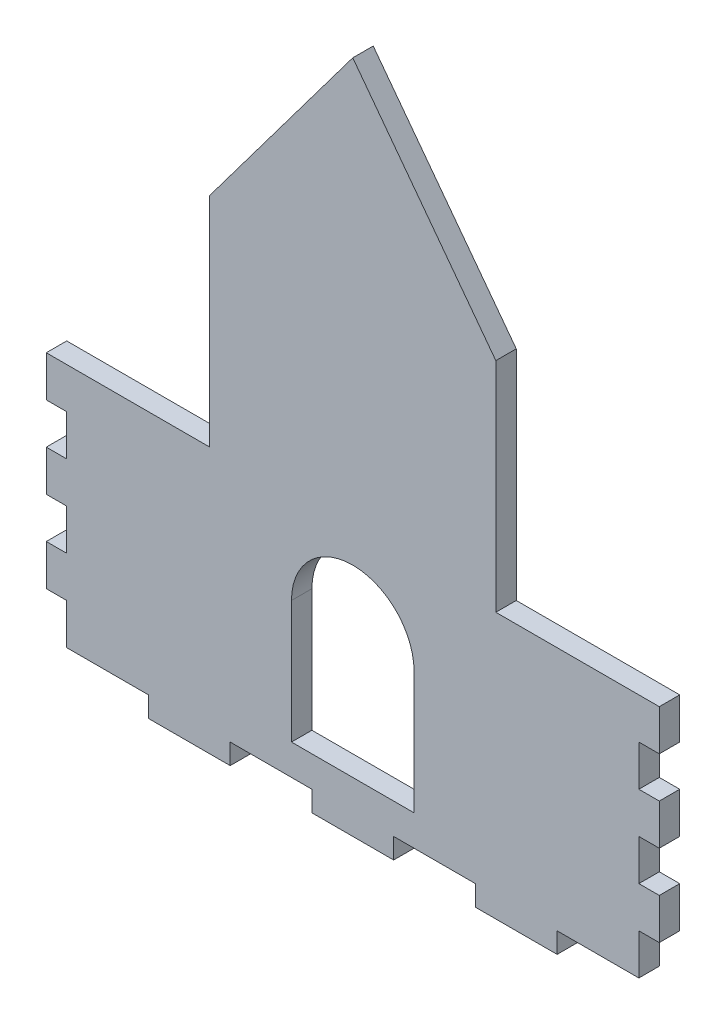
from build123d import *

# Parameters (mm, degrees)
BOSS_EXTRUDE1_DEPTH = 12.7
SKETCH2_W           = 12.7
SKETCH2_H           = 25.4
BOSS_EXTRUDE2_DEPTH = 12.7
SKETCH3_W           = 50.8
SKETCH3_H           = 12.7
BOSS_EXTRUDE3_DEPTH = 12.7
SKETCH4_W           = 76.2
SKETCH4_H           = 76.2
CUT_EXTRUDE1_DEPTH  = 12.7


with BuildPart() as part:
    # Sketch1 → Boss-Extrude1 (new body)
    with BuildSketch(Plane.XY):
        Polygon((266.7, 152.4), (355.6, 152.4), (355.6, 0), (0, 0), (0, 152.4), (88.9, 152.4), (88.9, 287.8582), (177.8, 406.4), (266.7, 287.8582), align=None)
    extrude(amount=BOSS_EXTRUDE1_DEPTH)

    # Sketch2 → Boss-Extrude2 (add)
    with BuildSketch(Plane.XY.offset(12.7)):
        with Locations((-6.35, 139.7)):
            Rectangle(SKETCH2_W, SKETCH2_H)
        with Locations((-6.35, 88.9)):
            Rectangle(SKETCH2_W, SKETCH2_H)
        with Locations((-6.35, 38.1)):
            Rectangle(SKETCH2_W, SKETCH2_H)
        with Locations((361.95, 139.7)):
            Rectangle(SKETCH2_W, SKETCH2_H)
        with Locations((361.95, 88.9)):
            Rectangle(SKETCH2_W, SKETCH2_H)
        with Locations((361.95, 38.1)):
            Rectangle(SKETCH2_W, SKETCH2_H)
    extrude(amount=-BOSS_EXTRUDE2_DEPTH)

    # Sketch3 → Boss-Extrude3 (add)
    with BuildSketch(Plane.XZ):
        with Locations((76.2, 6.35)):
            Rectangle(SKETCH3_W, SKETCH3_H)
        with Locations((177.8, 6.35)):
            Rectangle(SKETCH3_W, SKETCH3_H)
        with Locations((279.4, 6.35)):
            Rectangle(SKETCH3_W, SKETCH3_H)
    extrude(amount=BOSS_EXTRUDE3_DEPTH)

    # Sketch4 → Cut-Extrude1 (cut)
    with BuildSketch(Plane.XY.offset(12.7)):
        with Locations((177.8, 57.15)):
            Rectangle(SKETCH4_W, SKETCH4_H)
        with BuildLine():
            ThreePointArc((139.7, 95.25), (177.8, 133.35), (215.9, 95.25))
            Line((215.9, 95.25), (139.7, 95.25))
        make_face()
    extrude(amount=-CUT_EXTRUDE1_DEPTH, mode=Mode.SUBTRACT)


solid = part.part
